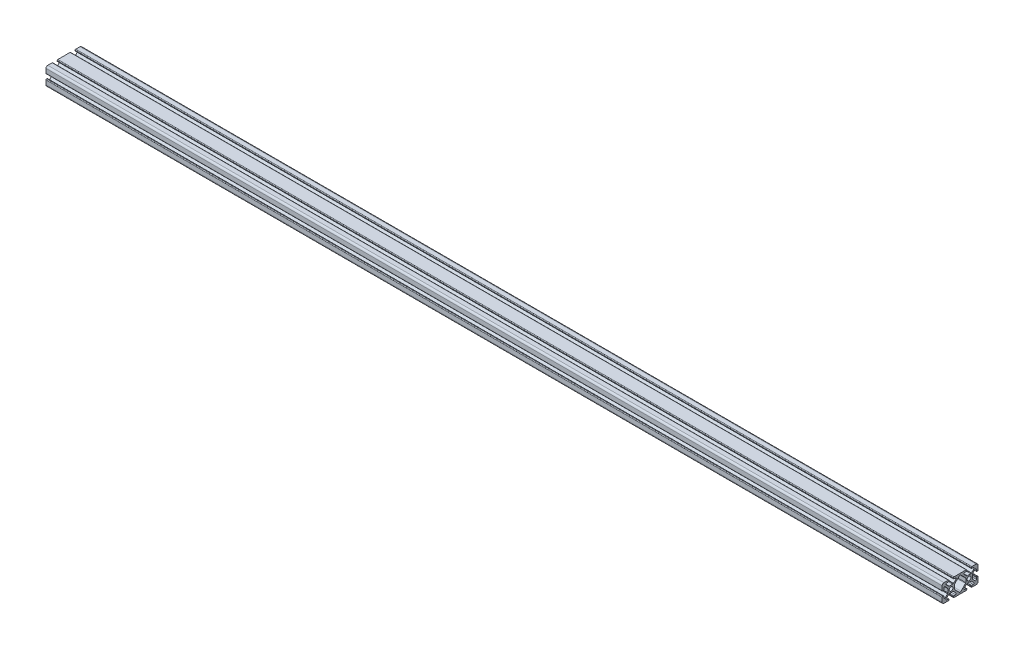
from build123d import *

# Parameters (mm, degrees)
MODEL_R                = 2.15
STRUKTURBAUTEIL1_DEPTH = 1000


with BuildPart() as part:
    # Model → Strukturbauteil1 (new body)
    with BuildSketch(Plane(origin=(0, 0, 0), x_dir=(0, 0, -1), z_dir=(1, 0, 0))):
        with BuildLine():
            Line((-20, -3.2), (-20, -8))
            ThreePointArc((-20, -8), (-19.414213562, -9.414213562), (-18, -10))
            Line((-18, -10), (-13.2, -10))
            ThreePointArc((-13.2, -10), (-12.705025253, -9.794974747), (-12.5, -9.3))
            Line((-12.5, -9.3), (-12.5, -8.7))
            ThreePointArc((-12.5, -8.7), (-12.646446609, -8.346446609), (-13, -8.2))
            Line((-13, -8.2), (-14.867588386, -8.2))
            ThreePointArc((-14.867588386, -8.2), (-15.682830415, -7.655272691), (-15.491547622, -6.69362915))
            Line((-15.491547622, -6.69362915), (-12.740811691, -3.942893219))
            Line((-12.740811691, -3.942893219), (-12.03370491, -3.65))
            Line((-12.03370491, -3.65), (-7.96629509, -3.65))
            Line((-7.96629509, -3.65), (-7.259188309, -3.942893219))
            Line((-7.259188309, -3.942893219), (-4.508452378, -6.69362915))
            ThreePointArc((-4.508452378, -6.69362915), (-4.317169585, -7.655272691), (-5.132411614, -8.2))
            Line((-5.132411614, -8.2), (-7, -8.2))
            ThreePointArc((-7, -8.2), (-7.353553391, -8.346446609), (-7.5, -8.7))
            Line((-7.5, -8.7), (-7.5, -9.3))
            ThreePointArc((-7.5, -9.3), (-7.294974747, -9.794974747), (-6.8, -10))
            Line((-6.8, -10), (6.8, -10))
            ThreePointArc((6.8, -10), (7.294974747, -9.794974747), (7.5, -9.3))
            Line((7.5, -9.3), (7.5, -8.7))
            ThreePointArc((7.5, -8.7), (7.353553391, -8.346446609), (7, -8.2))
            Line((7, -8.2), (5.132411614, -8.2))
            ThreePointArc((5.132411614, -8.2), (4.317169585, -7.655272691), (4.508452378, -6.69362915))
            Line((4.508452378, -6.69362915), (7.259188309, -3.942893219))
            Line((7.259188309, -3.942893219), (7.96629509, -3.65))
            Line((7.96629509, -3.65), (12.03370491, -3.65))
            Line((12.03370491, -3.65), (12.740811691, -3.942893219))
            Line((12.740811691, -3.942893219), (15.491547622, -6.69362915))
            ThreePointArc((15.491547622, -6.69362915), (15.682830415, -7.655272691), (14.867588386, -8.2))
            Line((14.867588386, -8.2), (13, -8.2))
            ThreePointArc((13, -8.2), (12.646446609, -8.346446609), (12.5, -8.7))
            Line((12.5, -8.7), (12.5, -9.3))
            ThreePointArc((12.5, -9.3), (12.705025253, -9.794974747), (13.2, -10))
            Line((13.2, -10), (18, -10))
            ThreePointArc((18, -10), (19.414213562, -9.414213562), (20, -8))
            Line((20, -8), (20, -3.2))
            ThreePointArc((20, -3.2), (19.794974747, -2.705025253), (19.3, -2.5))
            Line((19.3, -2.5), (18.7, -2.5))
            ThreePointArc((18.7, -2.5), (18.346446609, -2.646446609), (18.2, -3))
            Line((18.2, -3), (18.2, -4.867588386))
            ThreePointArc((18.2, -4.867588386), (17.655272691, -5.682830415), (16.69362915, -5.491547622))
            Line((16.69362915, -5.491547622), (13.942893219, -2.740811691))
            Line((13.942893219, -2.740811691), (13.65, -2.03370491))
            Line((13.65, -2.03370491), (13.65, 2.03370491))
            Line((13.65, 2.03370491), (13.942893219, 2.740811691))
            Line((13.942893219, 2.740811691), (16.69362915, 5.491547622))
            ThreePointArc((16.69362915, 5.491547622), (17.655272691, 5.682830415), (18.2, 4.867588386))
            Line((18.2, 4.867588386), (18.2, 3))
            ThreePointArc((18.2, 3), (18.346446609, 2.646446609), (18.7, 2.5))
            Line((18.7, 2.5), (19.3, 2.5))
            ThreePointArc((19.3, 2.5), (19.794974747, 2.705025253), (20, 3.2))
            Line((20, 3.2), (20, 8))
            ThreePointArc((20, 8), (19.414213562, 9.414213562), (18, 10))
            Line((18, 10), (13.2, 10))
            ThreePointArc((13.2, 10), (12.705025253, 9.794974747), (12.5, 9.3))
            Line((12.5, 9.3), (12.5, 8.7))
            ThreePointArc((12.5, 8.7), (12.646446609, 8.346446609), (13, 8.2))
            Line((13, 8.2), (14.867588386, 8.2))
            ThreePointArc((14.867588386, 8.2), (15.682830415, 7.655272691), (15.491547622, 6.69362915))
            Line((15.491547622, 6.69362915), (12.740811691, 3.942893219))
            Line((12.740811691, 3.942893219), (12.03370491, 3.65))
            Line((12.03370491, 3.65), (7.96629509, 3.65))
            Line((7.96629509, 3.65), (7.259188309, 3.942893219))
            Line((7.259188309, 3.942893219), (4.508452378, 6.69362915))
            ThreePointArc((4.508452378, 6.69362915), (4.317169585, 7.655272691), (5.132411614, 8.2))
            Line((5.132411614, 8.2), (7, 8.2))
            ThreePointArc((7, 8.2), (7.353553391, 8.346446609), (7.5, 8.7))
            Line((7.5, 8.7), (7.5, 9.3))
            ThreePointArc((7.5, 9.3), (7.294974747, 9.794974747), (6.8, 10))
            Line((6.8, 10), (-6.8, 10))
            ThreePointArc((-6.8, 10), (-7.294974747, 9.794974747), (-7.5, 9.3))
            Line((-7.5, 9.3), (-7.5, 8.7))
            ThreePointArc((-7.5, 8.7), (-7.353553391, 8.346446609), (-7, 8.2))
            Line((-7, 8.2), (-5.132411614, 8.2))
            ThreePointArc((-5.132411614, 8.2), (-4.317169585, 7.655272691), (-4.508452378, 6.69362915))
            Line((-4.508452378, 6.69362915), (-7.259188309, 3.942893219))
            Line((-7.259188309, 3.942893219), (-7.96629509, 3.65))
            Line((-7.96629509, 3.65), (-12.03370491, 3.65))
            Line((-12.03370491, 3.65), (-12.740811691, 3.942893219))
            Line((-12.740811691, 3.942893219), (-15.491547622, 6.69362915))
            ThreePointArc((-15.491547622, 6.69362915), (-15.682830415, 7.655272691), (-14.867588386, 8.2))
            Line((-14.867588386, 8.2), (-13, 8.2))
            ThreePointArc((-13, 8.2), (-12.646446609, 8.346446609), (-12.5, 8.7))
            Line((-12.5, 8.7), (-12.5, 9.3))
            ThreePointArc((-12.5, 9.3), (-12.705025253, 9.794974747), (-13.2, 10))
            Line((-13.2, 10), (-18, 10))
            ThreePointArc((-18, 10), (-19.414213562, 9.414213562), (-20, 8))
            Line((-20, 8), (-20, 3.2))
            ThreePointArc((-20, 3.2), (-19.794974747, 2.705025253), (-19.3, 2.5))
            Line((-19.3, 2.5), (-18.7, 2.5))
            ThreePointArc((-18.7, 2.5), (-18.346446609, 2.646446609), (-18.2, 3))
            Line((-18.2, 3), (-18.2, 4.867588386))
            ThreePointArc((-18.2, 4.867588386), (-17.655272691, 5.682830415), (-16.69362915, 5.491547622))
            Line((-16.69362915, 5.491547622), (-13.942893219, 2.740811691))
            Line((-13.942893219, 2.740811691), (-13.65, 2.03370491))
            Line((-13.65, 2.03370491), (-13.65, -2.03370491))
            Line((-13.65, -2.03370491), (-13.942893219, -2.740811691))
            Line((-13.942893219, -2.740811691), (-16.69362915, -5.491547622))
            ThreePointArc((-16.69362915, -5.491547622), (-17.655272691, -5.682830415), (-18.2, -4.867588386))
            Line((-18.2, -4.867588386), (-18.2, -3))
            ThreePointArc((-18.2, -3), (-18.346446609, -2.646446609), (-18.7, -2.5))
            Line((-18.7, -2.5), (-19.3, -2.5))
            ThreePointArc((-19.3, -2.5), (-19.794974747, -2.705025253), (-20, -3.2))
        make_face()
        with Locations((-10, 0)):
            Circle(MODEL_R, mode=Mode.SUBTRACT)
        with Locations((10, 0)):
            Circle(MODEL_R, mode=Mode.SUBTRACT)
        with BuildLine():
            Line((-6.35, -2.03370491), (-6.35, 2.03370491))
            ThreePointArc((-6.35, 2.03370491), (-6.273879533, 2.416388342), (-6.057106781, 2.740811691))
            Line((-6.057106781, 2.740811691), (-1.020710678, 7.777207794))
            ThreePointArc((-1.020710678, 7.777207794), (0, 8.2), (1.020710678, 7.777207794))
            Line((1.020710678, 7.777207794), (6.057106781, 2.740811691))
            ThreePointArc((6.057106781, 2.740811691), (6.273879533, 2.416388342), (6.35, 2.03370491))
            Line((6.35, 2.03370491), (6.35, -2.03370491))
            ThreePointArc((6.35, -2.03370491), (6.273879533, -2.416388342), (6.057106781, -2.740811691))
            Line((6.057106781, -2.740811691), (1.020710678, -7.777207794))
            ThreePointArc((1.020710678, -7.777207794), (0, -8.2), (-1.020710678, -7.777207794))
            Line((-1.020710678, -7.777207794), (-6.057106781, -2.740811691))
            ThreePointArc((-6.057106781, -2.740811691), (-6.273879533, -2.416388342), (-6.35, -2.03370491))
        make_face(mode=Mode.SUBTRACT)
    extrude(amount=STRUKTURBAUTEIL1_DEPTH)


solid = part.part
